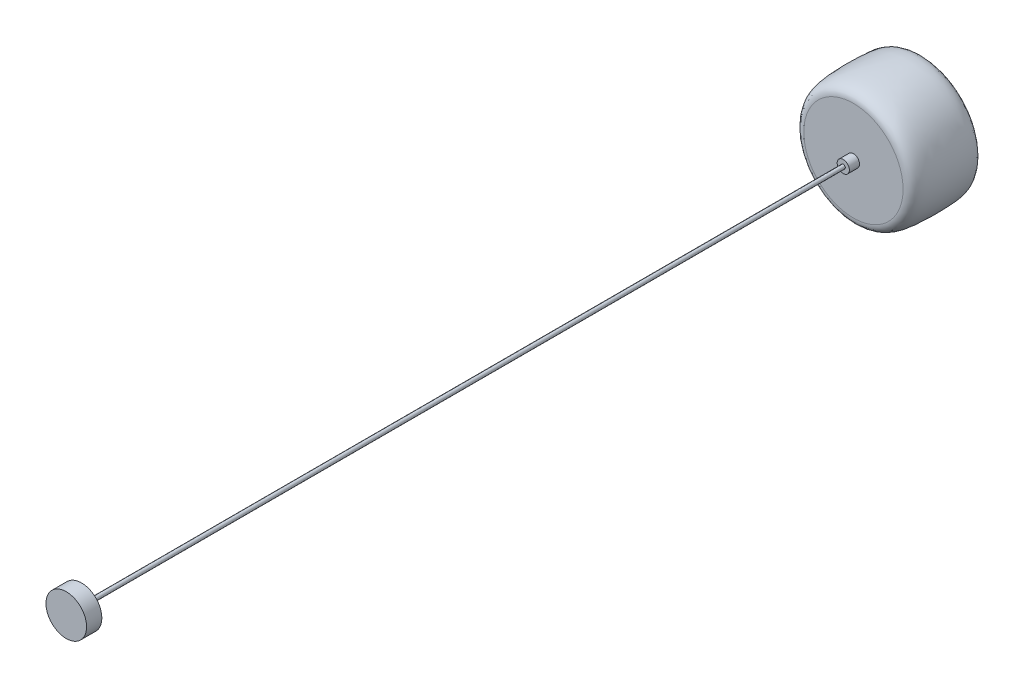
ISO-10303-21;
HEADER;
FILE_DESCRIPTION(('STEP AP214'),'2;1');
FILE_NAME('part.step','',(''),(''),'','','');
FILE_SCHEMA(('AUTOMOTIVE_DESIGN { 1 0 10303 214 1 1 1 1 }'));
ENDSEC;
DATA;
#1=APPLICATION_CONTEXT('core data for automotive mechanical design processes');
#2=APPLICATION_PROTOCOL_DEFINITION('international standard','automotive_design',2000,#1);
#3=PRODUCT_CONTEXT('',#1,'mechanical');
#4=PRODUCT('Part','Part','',(#3));
#5=PRODUCT_RELATED_PRODUCT_CATEGORY('part','',(#4));
#6=PRODUCT_DEFINITION_FORMATION('','',#4);
#7=PRODUCT_DEFINITION_CONTEXT('part definition',#1,'design');
#8=PRODUCT_DEFINITION('design','',#6,#7);
#9=PRODUCT_DEFINITION_SHAPE('','',#8);
#10=(LENGTH_UNIT() NAMED_UNIT(*) SI_UNIT(.MILLI.,.METRE.));
#11=(NAMED_UNIT(*) PLANE_ANGLE_UNIT() SI_UNIT($,.RADIAN.));
#12=(NAMED_UNIT(*) SI_UNIT($,.STERADIAN.) SOLID_ANGLE_UNIT());
#13=UNCERTAINTY_MEASURE_WITH_UNIT(LENGTH_MEASURE(1.E-05),#10,'distance_accuracy_value','');
#14=(GEOMETRIC_REPRESENTATION_CONTEXT(3) GLOBAL_UNCERTAINTY_ASSIGNED_CONTEXT((#13)) GLOBAL_UNIT_ASSIGNED_CONTEXT((#10,
#11,#12)) REPRESENTATION_CONTEXT('',''));
#15=CARTESIAN_POINT('',(0.,0.,0.));
#16=DIRECTION('',(0.,0.,1.));
#17=DIRECTION('',(1.,0.,0.));
#18=AXIS2_PLACEMENT_3D('',#15,#16,#17);
#19=CARTESIAN_POINT('',(-202.762577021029,-9.39848618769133E-13,538.));
#20=CARTESIAN_POINT('',(-202.762577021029,97.7625770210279,538.));
#21=CARTESIAN_POINT('',(-105.,97.7625770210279,538.));
#22=CARTESIAN_POINT('',(-7.23742297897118,97.7625770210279,538.));
#23=CARTESIAN_POINT('',(-7.23742297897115,-9.23402530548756E-13,538.));
#24=CARTESIAN_POINT('',(-7.23742297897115,-97.7625770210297,538.));
#25=CARTESIAN_POINT('',(-105.,-97.7625770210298,538.));
#26=CARTESIAN_POINT('',(-202.762577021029,-97.7625770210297,538.));
#27=CARTESIAN_POINT('',(-202.762577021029,-9.39848618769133E-13,538.));
#28=CARTESIAN_POINT('',(-173.508384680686,-9.39179281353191E-13,538.));
#29=CARTESIAN_POINT('',(-173.508384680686,68.5083846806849,538.));
#30=CARTESIAN_POINT('',(-105.,68.508384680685,538.));
#31=CARTESIAN_POINT('',(-36.4916153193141,68.5083846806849,538.));
#32=CARTESIAN_POINT('',(-36.4916153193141,-9.27654473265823E-13,538.));
#33=CARTESIAN_POINT('',(-36.4916153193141,-68.5083846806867,538.));
#34=CARTESIAN_POINT('',(-105.,-68.5083846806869,538.));
#35=CARTESIAN_POINT('',(-173.508384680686,-68.5083846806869,538.));
#36=CARTESIAN_POINT('',(-173.508384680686,-9.39179281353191E-13,538.));
#37=CARTESIAN_POINT('',(-144.254192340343,-9.38509943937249E-13,538.));
#38=CARTESIAN_POINT('',(-144.254192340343,39.254192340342,538.));
#39=CARTESIAN_POINT('',(-105.,39.254192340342,538.));
#40=CARTESIAN_POINT('',(-65.7458076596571,39.254192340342,538.));
#41=CARTESIAN_POINT('',(-65.7458076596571,-9.31906415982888E-13,538.));
#42=CARTESIAN_POINT('',(-65.7458076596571,-39.2541923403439,538.));
#43=CARTESIAN_POINT('',(-105.,-39.2541923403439,538.));
#44=CARTESIAN_POINT('',(-144.254192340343,-39.2541923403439,538.));
#45=CARTESIAN_POINT('',(-144.254192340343,-9.38509943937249E-13,538.));
#46=CARTESIAN_POINT('',(-115.,-9.37840606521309E-13,538.));
#47=CARTESIAN_POINT('',(-115.,9.99999999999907,538.));
#48=CARTESIAN_POINT('',(-105.,9.99999999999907,538.));
#49=CARTESIAN_POINT('',(-94.9999999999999,9.99999999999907,538.));
#50=CARTESIAN_POINT('',(-95.,-9.36158358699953E-13,538.));
#51=CARTESIAN_POINT('',(-94.9999999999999,-10.0000000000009,538.));
#52=CARTESIAN_POINT('',(-105.,-10.0000000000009,538.));
#53=CARTESIAN_POINT('',(-115.,-10.0000000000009,538.));
#54=CARTESIAN_POINT('',(-115.,-9.37840606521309E-13,538.));
#55=(BOUNDED_SURFACE() B_SPLINE_SURFACE(3,2,((#19,#20,#21,#22,#23,#24,#25,#26,#27),(#28,#29,#30,
#31,#32,#33,#34,#35,#36),(#37,#38,#39,#40,#41,#42,#43,#44,#45),(#46,#47,#48,#49,#50,#51,#52,#53,
#54)),.UNSPECIFIED.,.F.,.T.,.F.) B_SPLINE_SURFACE_WITH_KNOTS((4,4),(3,2,2,2,3),
(-183.788922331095,-12.4054077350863),(0.,191.105053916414,382.210107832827,573.31516174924,
764.420215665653),.UNSPECIFIED.) GEOMETRIC_REPRESENTATION_ITEM() RATIONAL_B_SPLINE_SURFACE(((1.,
0.707106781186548,1.,0.707106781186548,1.,0.707106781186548,1.,0.707106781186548,1.),(1.,
0.707106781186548,1.,0.707106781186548,1.,0.707106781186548,1.,0.707106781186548,1.),(1.,
0.707106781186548,1.,0.707106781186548,1.,0.707106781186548,1.,0.707106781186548,1.),(1.,
0.707106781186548,1.,0.707106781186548,1.,0.707106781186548,1.,0.707106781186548,1.))) REPRESENTATION_ITEM('') SURFACE());
#56=CARTESIAN_POINT('',(-202.762577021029,-9.39848618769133E-13,538.));
#57=CARTESIAN_POINT('',(-202.762577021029,97.7625770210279,538.));
#58=CARTESIAN_POINT('',(-105.,97.7625770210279,538.));
#59=CARTESIAN_POINT('',(-7.23742297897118,97.7625770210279,538.));
#60=CARTESIAN_POINT('',(-7.23742297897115,-9.23402530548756E-13,538.));
#61=CARTESIAN_POINT('',(-7.23742297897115,-97.7625770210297,538.));
#62=CARTESIAN_POINT('',(-105.,-97.7625770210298,538.));
#63=CARTESIAN_POINT('',(-202.762577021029,-97.7625770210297,538.));
#64=CARTESIAN_POINT('',(-202.762577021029,-9.39848618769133E-13,538.));
#65=(BOUNDED_CURVE() B_SPLINE_CURVE(2,(#56,#57,#58,#59,#60,#61,#62,#63,#64),.UNSPECIFIED.,.T.,
.F.) B_SPLINE_CURVE_WITH_KNOTS((3,2,2,2,3),(0.,191.105053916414,382.210107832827,
573.31516174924,764.420215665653),
.UNSPECIFIED.) CURVE() GEOMETRIC_REPRESENTATION_ITEM() RATIONAL_B_SPLINE_CURVE((1.,
0.707106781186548,1.,0.707106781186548,1.,0.707106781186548,1.,0.707106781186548,1.)) REPRESENTATION_ITEM(''));
#66=CARTESIAN_POINT('',(-202.762577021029,-9.39848618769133E-13,538.));
#67=VERTEX_POINT('',#66);
#68=EDGE_CURVE('E158',#67,#67,#65,.T.);
#69=CARTESIAN_POINT('',(-105.,-9.2894442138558E-13,538.));
#70=DIRECTION('',(0.,0.,1.));
#71=DIRECTION('',(1.,0.,0.));
#72=AXIS2_PLACEMENT_3D('',#69,#70,#71);
#73=CIRCLE('',#72,12.);
#74=CARTESIAN_POINT('',(-93.,-9.2894442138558E-13,538.));
#75=VERTEX_POINT('',#74);
#76=EDGE_CURVE('E161',#75,#75,#73,.T.);
#77=ORIENTED_EDGE('',*,*,#68,.F.);
#78=EDGE_LOOP('',(#77));
#79=FACE_BOUND('',#78,.T.);
#80=ORIENTED_EDGE('',*,*,#76,.F.);
#81=EDGE_LOOP('',(#80));
#82=FACE_BOUND('',#81,.T.);
#83=ADVANCED_FACE('F55',(#79,#82),#55,.T.);
#84=CARTESIAN_POINT('',(-95.,-9.37611806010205E-13,516.903740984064));
#85=CARTESIAN_POINT('',(-95.,-9.37611806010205E-13,567.751629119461));
#86=CARTESIAN_POINT('',(-94.9999999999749,-10.0000000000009,516.903740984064));
#87=CARTESIAN_POINT('',(-94.9999999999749,-10.0000000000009,567.751629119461));
#88=CARTESIAN_POINT('',(-105.,-10.0000000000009,516.903740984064));
#89=CARTESIAN_POINT('',(-105.,-10.0000000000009,567.751629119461));
#90=CARTESIAN_POINT('',(-114.999999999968,-10.0000000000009,516.903740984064));
#91=CARTESIAN_POINT('',(-114.999999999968,-10.0000000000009,567.751629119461));
#92=CARTESIAN_POINT('',(-115.,-9.38836452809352E-13,516.903740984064));
#93=CARTESIAN_POINT('',(-115.,-9.38836452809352E-13,567.751629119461));
#94=CARTESIAN_POINT('',(-114.999999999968,9.99999999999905,516.903740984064));
#95=CARTESIAN_POINT('',(-114.999999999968,9.99999999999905,567.751629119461));
#96=CARTESIAN_POINT('',(-105.,9.99999999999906,516.903740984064));
#97=CARTESIAN_POINT('',(-105.,9.99999999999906,567.751629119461));
#98=CARTESIAN_POINT('',(-94.9999999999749,9.99999999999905,516.903740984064));
#99=CARTESIAN_POINT('',(-94.9999999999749,9.99999999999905,567.751629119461));
#100=CARTESIAN_POINT('',(-95.,-9.37611806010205E-13,516.903740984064));
#101=CARTESIAN_POINT('',(-95.,-9.37611806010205E-13,567.751629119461));
#102=(BOUNDED_SURFACE() B_SPLINE_SURFACE(2,1,((#84,#85),(#86,#87),(#88,#89),(#90,#91),(#92,#93),
(#94,#95),(#96,#97),(#98,#99),(#100,#101)),.UNSPECIFIED.,.T.,.F.,
.F.) B_SPLINE_SURFACE_WITH_KNOTS((3,2,2,2,3),(2,2),(0.,15.7079632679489,31.415926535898,
47.1238898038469,62.8318530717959),(0.,8.65537010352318),
.UNSPECIFIED.) GEOMETRIC_REPRESENTATION_ITEM() RATIONAL_B_SPLINE_SURFACE(((1.,1.),
(0.707106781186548,0.707106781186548),(1.,1.),(0.707106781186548,0.707106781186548),(1.,1.),
(0.707106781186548,0.707106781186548),(1.,1.),(0.707106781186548,0.707106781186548),(1.,1.))) REPRESENTATION_ITEM('') SURFACE());
#103=CARTESIAN_POINT('',(-95.,-9.37611806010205E-13,538.));
#104=CARTESIAN_POINT('',(-94.9999999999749,9.99999999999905,538.));
#105=CARTESIAN_POINT('',(-105.,9.99999999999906,538.));
#106=CARTESIAN_POINT('',(-114.999999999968,9.99999999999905,538.));
#107=CARTESIAN_POINT('',(-115.,-9.38836452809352E-13,538.));
#108=CARTESIAN_POINT('',(-114.999999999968,-10.0000000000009,538.));
#109=CARTESIAN_POINT('',(-105.,-10.0000000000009,538.));
#110=CARTESIAN_POINT('',(-94.9999999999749,-10.0000000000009,538.));
#111=CARTESIAN_POINT('',(-95.,-9.37611806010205E-13,538.));
#112=(BOUNDED_CURVE() B_SPLINE_CURVE(2,(#103,#104,#105,#106,#107,#108,#109,#110,#111),
.UNSPECIFIED.,.T.,.F.) B_SPLINE_CURVE_WITH_KNOTS((3,2,2,2,3),(0.,15.707963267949,
31.415926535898,47.123889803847,62.8318530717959),
.UNSPECIFIED.) CURVE() GEOMETRIC_REPRESENTATION_ITEM() RATIONAL_B_SPLINE_CURVE((1.,
0.707106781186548,1.,0.707106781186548,1.,0.707106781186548,1.,0.707106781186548,1.)) REPRESENTATION_ITEM(''));
#113=CARTESIAN_POINT('',(-95.,-9.36158358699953E-13,538.));
#114=VERTEX_POINT('',#113);
#115=CARTESIAN_POINT('',(-115.,-8.28310601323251E-13,538.));
#116=VERTEX_POINT('',#115);
#117=EDGE_CURVE('E84',#114,#116,#112,.F.);
#118=CARTESIAN_POINT('',(-95.,-9.37611806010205E-13,538.));
#119=CARTESIAN_POINT('',(-94.9999999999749,9.99999999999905,538.));
#120=CARTESIAN_POINT('',(-105.,9.99999999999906,538.));
#121=CARTESIAN_POINT('',(-114.999999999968,9.99999999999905,538.));
#122=CARTESIAN_POINT('',(-115.,-9.38836452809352E-13,538.));
#123=CARTESIAN_POINT('',(-114.999999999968,-10.0000000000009,538.));
#124=CARTESIAN_POINT('',(-105.,-10.0000000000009,538.));
#125=CARTESIAN_POINT('',(-94.9999999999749,-10.0000000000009,538.));
#126=CARTESIAN_POINT('',(-95.,-9.37611806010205E-13,538.));
#127=(BOUNDED_CURVE() B_SPLINE_CURVE(2,(#118,#119,#120,#121,#122,#123,#124,#125,#126),
.UNSPECIFIED.,.T.,.F.) B_SPLINE_CURVE_WITH_KNOTS((3,2,2,2,3),(0.,15.707963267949,
31.415926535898,47.123889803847,62.8318530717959),
.UNSPECIFIED.) CURVE() GEOMETRIC_REPRESENTATION_ITEM() RATIONAL_B_SPLINE_CURVE((1.,
0.707106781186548,1.,0.707106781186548,1.,0.707106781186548,1.,0.707106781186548,1.)) REPRESENTATION_ITEM(''));
#128=EDGE_CURVE('E78',#116,#114,#127,.F.);
#129=CARTESIAN_POINT('',(-115.,-9.35138232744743E-13,531.000032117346));
#130=CARTESIAN_POINT('',(-115.,-10.0000000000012,531.000032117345));
#131=CARTESIAN_POINT('',(-105.,-10.0000000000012,531.000032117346));
#132=CARTESIAN_POINT('',(-94.9999999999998,-10.0000000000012,531.000032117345));
#133=CARTESIAN_POINT('',(-94.9999999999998,-9.3886073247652E-13,531.000032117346));
#134=CARTESIAN_POINT('',(-94.9999999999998,9.99999999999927,531.000032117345));
#135=CARTESIAN_POINT('',(-105.,9.99999999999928,531.000032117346));
#136=CARTESIAN_POINT('',(-115.,9.99999999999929,531.000032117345));
#137=CARTESIAN_POINT('',(-115.,-9.35138232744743E-13,531.000032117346));
#138=(BOUNDED_CURVE() B_SPLINE_CURVE(2,(#129,#130,#131,#132,#133,#134,#135,#136,#137),
.UNSPECIFIED.,.T.,.F.) B_SPLINE_CURVE_WITH_KNOTS((3,2,2,2,3),(0.,191.105053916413,
382.210107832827,573.315161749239,764.420215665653),
.UNSPECIFIED.) CURVE() GEOMETRIC_REPRESENTATION_ITEM() RATIONAL_B_SPLINE_CURVE((1.,
0.707106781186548,1.,0.707106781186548,1.,0.707106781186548,1.,0.707106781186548,1.)) REPRESENTATION_ITEM(''));
#139=CARTESIAN_POINT('',(-95.,-9.3802811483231E-13,531.000032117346));
#140=VERTEX_POINT('',#139);
#141=CARTESIAN_POINT('',(-114.99999999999,-9.36370972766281E-13,531.000032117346));
#142=VERTEX_POINT('',#141);
#143=EDGE_CURVE('E91',#140,#142,#138,.T.);
#144=CARTESIAN_POINT('',(-114.999999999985,-9.35138232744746E-13,531.000032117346));
#145=CARTESIAN_POINT('',(-114.999999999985,-9.99999999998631,531.000032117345));
#146=CARTESIAN_POINT('',(-105.,-9.99999999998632,531.000032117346));
#147=CARTESIAN_POINT('',(-95.0000000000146,-9.99999999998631,531.000032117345));
#148=CARTESIAN_POINT('',(-95.0000000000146,-9.38860732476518E-13,531.000032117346));
#149=CARTESIAN_POINT('',(-95.0000000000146,9.99999999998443,531.000032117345));
#150=CARTESIAN_POINT('',(-105.,9.99999999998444,531.000032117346));
#151=CARTESIAN_POINT('',(-114.999999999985,9.99999999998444,531.000032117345));
#152=CARTESIAN_POINT('',(-114.999999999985,-9.35138232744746E-13,531.000032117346));
#153=(BOUNDED_CURVE() B_SPLINE_CURVE(2,(#144,#145,#146,#147,#148,#149,#150,#151,#152),
.UNSPECIFIED.,.T.,.F.) B_SPLINE_CURVE_WITH_KNOTS((3,2,2,2,3),(0.,191.105053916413,
382.210107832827,573.315161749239,764.420215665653),
.UNSPECIFIED.) CURVE() GEOMETRIC_REPRESENTATION_ITEM() RATIONAL_B_SPLINE_CURVE((1.,
0.707106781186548,1.,0.707106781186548,1.,0.707106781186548,1.,0.707106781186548,1.)) REPRESENTATION_ITEM(''));
#154=EDGE_CURVE('E88',#142,#140,#153,.T.);
#155=ORIENTED_EDGE('',*,*,#117,.F.);
#156=ORIENTED_EDGE('',*,*,#128,.F.);
#157=EDGE_LOOP('',(#155,#156));
#158=FACE_BOUND('',#157,.T.);
#159=ORIENTED_EDGE('',*,*,#143,.F.);
#160=ORIENTED_EDGE('',*,*,#154,.F.);
#161=EDGE_LOOP('',(#159,#160));
#162=FACE_BOUND('',#161,.T.);
#163=ADVANCED_FACE('F57',(#158,#162),#102,.T.);
#164=CARTESIAN_POINT('',(-114.999999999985,-9.35138232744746E-13,531.000032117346));
#165=CARTESIAN_POINT('',(-114.999999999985,9.99999999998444,531.000032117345));
#166=CARTESIAN_POINT('',(-105.,9.99999999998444,531.000032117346));
#167=CARTESIAN_POINT('',(-95.0000000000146,9.99999999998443,531.000032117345));
#168=CARTESIAN_POINT('',(-95.0000000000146,-9.38860732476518E-13,531.000032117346));
#169=CARTESIAN_POINT('',(-95.0000000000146,-9.99999999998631,531.000032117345));
#170=CARTESIAN_POINT('',(-105.,-9.99999999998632,531.000032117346));
#171=CARTESIAN_POINT('',(-114.999999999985,-9.99999999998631,531.000032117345));
#172=CARTESIAN_POINT('',(-114.999999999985,-9.35138232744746E-13,531.000032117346));
#173=CARTESIAN_POINT('',(-144.232099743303,-9.28978880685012E-13,531.000126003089));
#174=CARTESIAN_POINT('',(-144.232099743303,39.2320997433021,531.000126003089));
#175=CARTESIAN_POINT('',(-105.,39.2320997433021,531.000126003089));
#176=CARTESIAN_POINT('',(-65.7679002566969,39.2320997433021,531.000126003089));
#177=CARTESIAN_POINT('',(-65.7679002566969,-9.4144018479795E-13,531.000126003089));
#178=CARTESIAN_POINT('',(-65.7679002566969,-39.232099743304,531.000126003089));
#179=CARTESIAN_POINT('',(-105.,-39.232099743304,531.000126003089));
#180=CARTESIAN_POINT('',(-144.232099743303,-39.232099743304,531.000126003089));
#181=CARTESIAN_POINT('',(-144.232099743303,-9.28978880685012E-13,531.000126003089));
#182=CARTESIAN_POINT('',(-173.46419948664,-9.31871440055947E-13,531.000219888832));
#183=CARTESIAN_POINT('',(-173.464199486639,68.4641994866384,531.000219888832));
#184=CARTESIAN_POINT('',(-105.,68.4641994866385,531.000219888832));
#185=CARTESIAN_POINT('',(-36.5358005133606,68.4641994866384,531.000219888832));
#186=CARTESIAN_POINT('',(-36.5358005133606,-9.34967725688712E-13,531.000219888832));
#187=CARTESIAN_POINT('',(-36.5358005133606,-68.4641994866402,531.000219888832));
#188=CARTESIAN_POINT('',(-105.,-68.4641994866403,531.000219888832));
#189=CARTESIAN_POINT('',(-173.464199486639,-68.4641994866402,531.000219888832));
#190=CARTESIAN_POINT('',(-173.46419948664,-9.31871440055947E-13,531.000219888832));
#191=CARTESIAN_POINT('',(-202.696299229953,-9.34763999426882E-13,531.000313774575));
#192=CARTESIAN_POINT('',(-202.696299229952,97.6962992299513,531.000313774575));
#193=CARTESIAN_POINT('',(-105.,97.6962992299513,531.000313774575));
#194=CARTESIAN_POINT('',(-7.30370077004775,97.6962992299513,531.000313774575));
#195=CARTESIAN_POINT('',(-7.30370077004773,-9.28495266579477E-13,531.000313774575));
#196=CARTESIAN_POINT('',(-7.30370077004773,-97.6962992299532,531.000313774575));
#197=CARTESIAN_POINT('',(-105.,-97.6962992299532,531.000313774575));
#198=CARTESIAN_POINT('',(-202.696299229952,-97.6962992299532,531.000313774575));
#199=CARTESIAN_POINT('',(-202.696299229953,-9.34763999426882E-13,531.000313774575));
#200=(BOUNDED_SURFACE() B_SPLINE_SURFACE(3,2,((#164,#165,#166,#167,#168,#169,#170,#171,#172),
(#173,#174,#175,#176,#177,#178,#179,#180,#181),(#182,#183,#184,#185,#186,#187,#188,#189,#190),
(#191,#192,#193,#194,#195,#196,#197,#198,#199)),.UNSPECIFIED.,.F.,.T.,
.F.) B_SPLINE_SURFACE_WITH_KNOTS((4,4),(3,2,2,2,3),(-499.545143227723,-328.174876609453),(0.,
191.105053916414,382.210107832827,573.31516174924,764.420215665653),
.UNSPECIFIED.) GEOMETRIC_REPRESENTATION_ITEM() RATIONAL_B_SPLINE_SURFACE(((1.,0.707106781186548,
1.,0.707106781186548,1.,0.707106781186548,1.,0.707106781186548,1.),(1.,0.707106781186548,1.,
0.707106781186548,1.,0.707106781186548,1.,0.707106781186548,1.),(1.,0.707106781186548,1.,
0.707106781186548,1.,0.707106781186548,1.,0.707106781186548,1.),(1.,0.707106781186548,1.,
0.707106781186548,1.,0.707106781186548,1.,0.707106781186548,1.))) REPRESENTATION_ITEM('') SURFACE());
#201=CARTESIAN_POINT('',(-202.696299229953,-9.34763999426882E-13,531.000313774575));
#202=CARTESIAN_POINT('',(-202.696299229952,97.6962992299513,531.000313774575));
#203=CARTESIAN_POINT('',(-105.,97.6962992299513,531.000313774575));
#204=CARTESIAN_POINT('',(-7.30370077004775,97.6962992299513,531.000313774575));
#205=CARTESIAN_POINT('',(-7.30370077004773,-9.28495266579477E-13,531.000313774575));
#206=CARTESIAN_POINT('',(-7.30370077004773,-97.6962992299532,531.000313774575));
#207=CARTESIAN_POINT('',(-105.,-97.6962992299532,531.000313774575));
#208=CARTESIAN_POINT('',(-202.696299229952,-97.6962992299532,531.000313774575));
#209=CARTESIAN_POINT('',(-202.696299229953,-9.34763999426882E-13,531.000313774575));
#210=(BOUNDED_CURVE() B_SPLINE_CURVE(2,(#201,#202,#203,#204,#205,#206,#207,#208,#209),
.UNSPECIFIED.,.T.,.F.) B_SPLINE_CURVE_WITH_KNOTS((3,2,2,2,3),(0.,191.105053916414,
382.210107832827,573.31516174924,764.420215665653),
.UNSPECIFIED.) CURVE() GEOMETRIC_REPRESENTATION_ITEM() RATIONAL_B_SPLINE_CURVE((1.,
0.707106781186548,1.,0.707106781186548,1.,0.707106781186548,1.,0.707106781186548,1.)) REPRESENTATION_ITEM(''));
#211=CARTESIAN_POINT('',(-202.696299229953,-9.34763999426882E-13,531.000313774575));
#212=VERTEX_POINT('',#211);
#213=EDGE_CURVE('E70',#212,#212,#210,.T.);
#214=ORIENTED_EDGE('',*,*,#213,.T.);
#215=EDGE_LOOP('',(#214));
#216=FACE_BOUND('',#215,.T.);
#217=ORIENTED_EDGE('',*,*,#143,.T.);
#218=ORIENTED_EDGE('',*,*,#154,.T.);
#219=EDGE_LOOP('',(#217,#218));
#220=FACE_BOUND('',#219,.T.);
#221=ADVANCED_FACE('F100',(#216,#220),#200,.T.);
#222=CARTESIAN_POINT('',(-202.696299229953,-9.34763999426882E-13,531.000313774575));
#223=CARTESIAN_POINT('',(-202.696299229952,97.6962992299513,531.000313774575));
#224=CARTESIAN_POINT('',(-105.,97.6962992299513,531.000313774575));
#225=CARTESIAN_POINT('',(-7.30370077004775,97.6962992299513,531.000313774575));
#226=CARTESIAN_POINT('',(-7.30370077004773,-9.28495266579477E-13,531.000313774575));
#227=CARTESIAN_POINT('',(-7.30370077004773,-97.6962992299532,531.000313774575));
#228=CARTESIAN_POINT('',(-105.,-97.6962992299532,531.000313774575));
#229=CARTESIAN_POINT('',(-202.696299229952,-97.6962992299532,531.000313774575));
#230=CARTESIAN_POINT('',(-202.696299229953,-9.34763999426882E-13,531.000313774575));
#231=CARTESIAN_POINT('',(-209.67450409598,-8.07855926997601E-13,531.11984691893));
#232=CARTESIAN_POINT('',(-209.674504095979,104.674504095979,531.11984691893));
#233=CARTESIAN_POINT('',(-105.,104.674504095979,531.11984691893));
#234=CARTESIAN_POINT('',(-0.3254959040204,104.674504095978,531.11984691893));
#235=CARTESIAN_POINT('',(-0.325495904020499,-1.05454875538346E-12,531.11984691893));
#236=CARTESIAN_POINT('',(-0.325495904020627,-104.67450409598,531.11984691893));
#237=CARTESIAN_POINT('',(-105.,-104.67450409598,531.11984691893));
#238=CARTESIAN_POINT('',(-209.674504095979,-104.67450409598,531.11984691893));
#239=CARTESIAN_POINT('',(-209.67450409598,-8.07855926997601E-13,531.11984691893));
#240=CARTESIAN_POINT('',(-215.842457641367,1.09129879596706E-13,521.418533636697));
#241=CARTESIAN_POINT('',(-215.842457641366,110.842457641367,521.418533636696));
#242=CARTESIAN_POINT('',(-105.,110.842457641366,521.418533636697));
#243=CARTESIAN_POINT('',(5.84245764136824,110.842457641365,521.418533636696));
#244=CARTESIAN_POINT('',(5.84245764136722,-1.9707792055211E-12,521.418533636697));
#245=CARTESIAN_POINT('',(5.84245764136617,-110.842457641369,521.418533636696));
#246=CARTESIAN_POINT('',(-105.,-110.842457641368,521.418533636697));
#247=CARTESIAN_POINT('',(-215.842457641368,-110.842457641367,521.418533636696));
#248=CARTESIAN_POINT('',(-215.842457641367,1.09129879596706E-13,521.418533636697));
#249=CARTESIAN_POINT('',(-218.939659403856,-9.20267986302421E-13,498.464920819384));
#250=CARTESIAN_POINT('',(-218.939659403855,113.939659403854,498.464920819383));
#251=CARTESIAN_POINT('',(-105.,113.939659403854,498.464920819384));
#252=CARTESIAN_POINT('',(8.93965940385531,113.939659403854,498.464920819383));
#253=CARTESIAN_POINT('',(8.93965940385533,-9.41002041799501E-13,498.464920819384));
#254=CARTESIAN_POINT('',(8.93965940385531,-113.939659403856,498.464920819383));
#255=CARTESIAN_POINT('',(-105.,-113.939659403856,498.464920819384));
#256=CARTESIAN_POINT('',(-218.939659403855,-113.939659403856,498.464920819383));
#257=CARTESIAN_POINT('',(-218.939659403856,-9.20267986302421E-13,498.464920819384));
#258=CARTESIAN_POINT('',(-219.768596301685,5.06427626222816E-13,475.859894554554));
#259=CARTESIAN_POINT('',(-219.768596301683,114.768596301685,475.859894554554));
#260=CARTESIAN_POINT('',(-104.999999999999,114.768596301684,475.859894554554));
#261=CARTESIAN_POINT('',(9.76859630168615,114.768596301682,475.859894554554));
#262=CARTESIAN_POINT('',(9.76859630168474,-2.36759613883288E-12,475.859894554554));
#263=CARTESIAN_POINT('',(9.76859630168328,-114.768596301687,475.859894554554));
#264=CARTESIAN_POINT('',(-105.000000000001,-114.768596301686,475.859894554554));
#265=CARTESIAN_POINT('',(-219.768596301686,-114.768596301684,475.859894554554));
#266=CARTESIAN_POINT('',(-219.768596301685,5.06427626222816E-13,475.859894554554));
#267=CARTESIAN_POINT('',(-219.724028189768,-1.54692235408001E-12,453.02451690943));
#268=CARTESIAN_POINT('',(-219.724028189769,114.724028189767,453.024516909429));
#269=CARTESIAN_POINT('',(-105.,114.724028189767,453.02451690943));
#270=CARTESIAN_POINT('',(9.72402818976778,114.724028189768,453.024516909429));
#271=CARTESIAN_POINT('',(9.72402818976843,-3.14251616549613E-13,453.02451690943));
#272=CARTESIAN_POINT('',(9.72402818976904,-114.724028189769,453.024516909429));
#273=CARTESIAN_POINT('',(-105.,-114.724028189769,453.02451690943));
#274=CARTESIAN_POINT('',(-219.724028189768,-114.72402818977,453.024516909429));
#275=CARTESIAN_POINT('',(-219.724028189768,-1.54692235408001E-12,453.02451690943));
#276=CARTESIAN_POINT('',(-219.046889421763,-7.8437757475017E-13,437.097337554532));
#277=CARTESIAN_POINT('',(-219.046889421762,114.046889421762,437.097337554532));
#278=CARTESIAN_POINT('',(-105.,114.046889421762,437.097337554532));
#279=CARTESIAN_POINT('',(9.04688942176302,114.046889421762,437.097337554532));
#280=CARTESIAN_POINT('',(9.0468894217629,-1.07687932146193E-12,437.097337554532));
#281=CARTESIAN_POINT('',(9.04688942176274,-114.046889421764,437.097337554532));
#282=CARTESIAN_POINT('',(-105.,-114.046889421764,437.097337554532));
#283=CARTESIAN_POINT('',(-219.046889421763,-114.046889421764,437.097337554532));
#284=CARTESIAN_POINT('',(-219.046889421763,-7.8437757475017E-13,437.097337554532));
#285=CARTESIAN_POINT('',(-218.63151717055,-1.55975047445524E-12,415.788249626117));
#286=CARTESIAN_POINT('',(-218.631517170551,113.631517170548,415.788249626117));
#287=CARTESIAN_POINT('',(-105.,113.631517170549,415.788249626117));
#288=CARTESIAN_POINT('',(8.6315171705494,113.63151717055,415.788249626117));
#289=CARTESIAN_POINT('',(8.63151717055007,-3.01557290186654E-13,415.788249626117));
#290=CARTESIAN_POINT('',(8.63151717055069,-113.63151717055,415.788249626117));
#291=CARTESIAN_POINT('',(-105.,-113.631517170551,415.788249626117));
#292=CARTESIAN_POINT('',(-218.631517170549,-113.631517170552,415.788249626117));
#293=CARTESIAN_POINT('',(-218.63151717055,-1.55975047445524E-12,415.788249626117));
#294=CARTESIAN_POINT('',(-213.353672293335,-1.19591363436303E-12,409.652207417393));
#295=CARTESIAN_POINT('',(-213.353672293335,108.353672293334,409.652207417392));
#296=CARTESIAN_POINT('',(-105.,108.353672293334,409.652207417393));
#297=CARTESIAN_POINT('',(3.35367229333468,108.353672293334,409.652207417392));
#298=CARTESIAN_POINT('',(3.35367229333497,-6.66040479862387E-13,409.652207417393));
#299=CARTESIAN_POINT('',(3.35367229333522,-108.353672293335,409.652207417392));
#300=CARTESIAN_POINT('',(-105.,-108.353672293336,409.652207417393));
#301=CARTESIAN_POINT('',(-213.353672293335,-108.353672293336,409.652207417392));
#302=CARTESIAN_POINT('',(-213.353672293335,-1.19591363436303E-12,409.652207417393));
#303=CARTESIAN_POINT('',(-207.173456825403,-9.72202383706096E-13,409.242963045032));
#304=CARTESIAN_POINT('',(-207.173456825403,102.173456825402,409.242963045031));
#305=CARTESIAN_POINT('',(-105.,102.173456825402,409.242963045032));
#306=CARTESIAN_POINT('',(-2.82654317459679,102.173456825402,409.242963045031));
#307=CARTESIAN_POINT('',(-2.82654317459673,-8.90508588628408E-13,409.242963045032));
#308=CARTESIAN_POINT('',(-2.82654317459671,-102.173456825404,409.242963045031));
#309=CARTESIAN_POINT('',(-105.,-102.173456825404,409.242963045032));
#310=CARTESIAN_POINT('',(-207.173456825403,-102.173456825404,409.242963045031));
#311=CARTESIAN_POINT('',(-207.173456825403,-9.72202383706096E-13,409.242963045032));
#312=CARTESIAN_POINT('',(-206.296171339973,-9.54783542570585E-13,409.184870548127));
#313=CARTESIAN_POINT('',(-206.296171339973,101.296171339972,409.184870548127));
#314=CARTESIAN_POINT('',(-105.,101.296171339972,409.184870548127));
#315=CARTESIAN_POINT('',(-3.70382866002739,101.296171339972,409.184870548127));
#316=CARTESIAN_POINT('',(-3.70382866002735,-9.08034866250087E-13,409.184870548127));
#317=CARTESIAN_POINT('',(-3.70382866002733,-101.296171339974,409.184870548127));
#318=CARTESIAN_POINT('',(-105.,-101.296171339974,409.184870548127));
#319=CARTESIAN_POINT('',(-206.296171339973,-101.296171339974,409.184870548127));
#320=CARTESIAN_POINT('',(-206.296171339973,-9.54783542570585E-13,409.184870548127));
#321=CARTESIAN_POINT('',(-205.614128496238,-9.40285578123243E-13,408.630053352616));
#322=CARTESIAN_POINT('',(-205.614128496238,100.614128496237,408.630053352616));
#323=CARTESIAN_POINT('',(-105.,100.614128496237,408.630053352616));
#324=CARTESIAN_POINT('',(-4.38587150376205,100.614128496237,408.630053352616));
#325=CARTESIAN_POINT('',(-4.38587150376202,-9.22616356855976E-13,408.630053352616));
#326=CARTESIAN_POINT('',(-4.38587150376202,-100.614128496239,408.630053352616));
#327=CARTESIAN_POINT('',(-105.,-100.614128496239,408.630053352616));
#328=CARTESIAN_POINT('',(-205.614128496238,-100.614128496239,408.630053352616));
#329=CARTESIAN_POINT('',(-205.614128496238,-9.40285578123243E-13,408.630053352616));
#330=CARTESIAN_POINT('',(-205.378663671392,-9.34051045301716E-13,407.782963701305));
#331=CARTESIAN_POINT('',(-205.378663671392,100.378663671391,407.782963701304));
#332=CARTESIAN_POINT('',(-105.,100.378663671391,407.782963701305));
#333=CARTESIAN_POINT('',(-4.62133632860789,100.378663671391,407.782963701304));
#334=CARTESIAN_POINT('',(-4.62133632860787,-9.28879725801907E-13,407.782963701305));
#335=CARTESIAN_POINT('',(-4.62133632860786,-100.378663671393,407.782963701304));
#336=CARTESIAN_POINT('',(-105.,-100.378663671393,407.782963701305));
#337=CARTESIAN_POINT('',(-205.378663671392,-100.378663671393,407.782963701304));
#338=CARTESIAN_POINT('',(-205.378663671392,-9.34051045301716E-13,407.782963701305));
#339=CARTESIAN_POINT('',(-205.190243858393,-9.36249822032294E-13,407.105119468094));
#340=CARTESIAN_POINT('',(-205.190243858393,100.190243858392,407.105119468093));
#341=CARTESIAN_POINT('',(-105.,100.190243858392,407.105119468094));
#342=CARTESIAN_POINT('',(-4.80975614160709,100.190243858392,407.105119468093));
#343=CARTESIAN_POINT('',(-4.80975614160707,-9.26704023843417E-13,407.105119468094));
#344=CARTESIAN_POINT('',(-4.80975614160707,-100.190243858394,407.105119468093));
#345=CARTESIAN_POINT('',(-105.,-100.190243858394,407.105119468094));
#346=CARTESIAN_POINT('',(-205.190243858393,-100.190243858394,407.105119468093));
#347=CARTESIAN_POINT('',(-205.190243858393,-9.36249822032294E-13,407.105119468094));
#348=CARTESIAN_POINT('',(-204.997664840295,-9.38936732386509E-13,405.653191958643));
#349=CARTESIAN_POINT('',(-204.997664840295,99.9976648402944,405.653191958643));
#350=CARTESIAN_POINT('',(-105.,99.9976648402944,405.653191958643));
#351=CARTESIAN_POINT('',(-5.0023351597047,99.9976648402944,405.653191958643));
#352=CARTESIAN_POINT('',(-5.00233515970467,-9.24040697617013E-13,405.653191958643));
#353=CARTESIAN_POINT('',(-5.00233515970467,-99.9976648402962,405.653191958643));
#354=CARTESIAN_POINT('',(-105.,-99.9976648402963,405.653191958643));
#355=CARTESIAN_POINT('',(-204.997664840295,-99.9976648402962,405.653191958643));
#356=CARTESIAN_POINT('',(-204.997664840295,-9.38936732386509E-13,405.653191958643));
#357=CARTESIAN_POINT('',(-205.355264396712,-9.36333341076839E-13,404.229127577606));
#358=CARTESIAN_POINT('',(-205.355264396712,100.355264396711,404.229127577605));
#359=CARTESIAN_POINT('',(-105.,100.355264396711,404.229127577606));
#360=CARTESIAN_POINT('',(-4.64473560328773,100.355264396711,404.229127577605));
#361=CARTESIAN_POINT('',(-4.6447356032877,-9.26600295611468E-13,404.229127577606));
#362=CARTESIAN_POINT('',(-4.6447356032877,-100.355264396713,404.229127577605));
#363=CARTESIAN_POINT('',(-105.,-100.355264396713,404.229127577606));
#364=CARTESIAN_POINT('',(-205.355264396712,-100.355264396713,404.229127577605));
#365=CARTESIAN_POINT('',(-205.355264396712,-9.36333341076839E-13,404.229127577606));
#366=CARTESIAN_POINT('',(-205.640392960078,-9.33999610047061E-13,403.539091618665));
#367=CARTESIAN_POINT('',(-205.640392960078,100.640392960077,403.539091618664));
#368=CARTESIAN_POINT('',(-105.,100.640392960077,403.539091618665));
#369=CARTESIAN_POINT('',(-4.35960703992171,100.640392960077,403.539091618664));
#370=CARTESIAN_POINT('',(-4.35960703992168,-9.28899108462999E-13,403.539091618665));
#371=CARTESIAN_POINT('',(-4.35960703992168,-100.640392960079,403.539091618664));
#372=CARTESIAN_POINT('',(-105.,-100.640392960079,403.539091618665));
#373=CARTESIAN_POINT('',(-205.640392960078,-100.640392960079,403.539091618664));
#374=CARTESIAN_POINT('',(-205.640392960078,-9.33999610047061E-13,403.539091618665));
#375=CARTESIAN_POINT('',(-205.988777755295,-9.3046179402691E-13,402.69597006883));
#376=CARTESIAN_POINT('',(-205.988777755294,100.988777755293,402.69597006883));
#377=CARTESIAN_POINT('',(-105.,100.988777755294,402.69597006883));
#378=CARTESIAN_POINT('',(-4.01122224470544,100.988777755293,402.69597006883));
#379=CARTESIAN_POINT('',(-4.01122224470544,-9.32394259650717E-13,402.69597006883));
#380=CARTESIAN_POINT('',(-4.01122224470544,-100.988777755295,402.69597006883));
#381=CARTESIAN_POINT('',(-105.,-100.988777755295,402.69597006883));
#382=CARTESIAN_POINT('',(-205.988777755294,-100.988777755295,402.69597006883));
#383=CARTESIAN_POINT('',(-205.988777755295,-9.3046179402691E-13,402.69597006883));
#384=CARTESIAN_POINT('',(-206.770296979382,-9.28162889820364E-13,402.225381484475));
#385=CARTESIAN_POINT('',(-206.770296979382,101.770296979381,402.225381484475));
#386=CARTESIAN_POINT('',(-105.,101.770296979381,402.225381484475));
#387=CARTESIAN_POINT('',(-3.22970302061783,101.770296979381,402.225381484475));
#388=CARTESIAN_POINT('',(-3.22970302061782,-9.34597455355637E-13,402.225381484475));
#389=CARTESIAN_POINT('',(-3.22970302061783,-101.770296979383,402.225381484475));
#390=CARTESIAN_POINT('',(-105.,-101.770296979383,402.225381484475));
#391=CARTESIAN_POINT('',(-206.770296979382,-101.770296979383,402.225381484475));
#392=CARTESIAN_POINT('',(-206.770296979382,-9.28162889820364E-13,402.225381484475));
#393=CARTESIAN_POINT('',(-207.678450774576,-9.28004492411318E-13,402.3118834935));
#394=CARTESIAN_POINT('',(-207.678450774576,102.678450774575,402.3118834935));
#395=CARTESIAN_POINT('',(-105.,102.678450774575,402.3118834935));
#396=CARTESIAN_POINT('',(-2.32154922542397,102.678450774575,402.3118834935));
#397=CARTESIAN_POINT('',(-2.32154922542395,-9.34644636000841E-13,402.3118834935));
#398=CARTESIAN_POINT('',(-2.32154922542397,-102.678450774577,402.3118834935));
#399=CARTESIAN_POINT('',(-105.,-102.678450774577,402.3118834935));
#400=CARTESIAN_POINT('',(-207.678450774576,-102.678450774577,402.3118834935));
#401=CARTESIAN_POINT('',(-207.678450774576,-9.28004492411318E-13,402.3118834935));
#402=CARTESIAN_POINT('',(-223.962146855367,-9.27903389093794E-13,403.862912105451));
#403=CARTESIAN_POINT('',(-223.962146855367,118.962146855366,403.86291210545));
#404=CARTESIAN_POINT('',(-105.,118.962146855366,403.862912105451));
#405=CARTESIAN_POINT('',(13.9621468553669,118.962146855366,403.86291210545));
#406=CARTESIAN_POINT('',(13.9621468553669,-9.32751561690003E-13,403.862912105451));
#407=CARTESIAN_POINT('',(13.9621468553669,-118.962146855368,403.86291210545));
#408=CARTESIAN_POINT('',(-105.,-118.962146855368,403.862912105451));
#409=CARTESIAN_POINT('',(-223.962146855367,-118.962146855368,403.86291210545));
#410=CARTESIAN_POINT('',(-223.962146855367,-9.27903389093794E-13,403.862912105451));
#411=CARTESIAN_POINT('',(-226.477466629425,-9.39848618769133E-13,426.688938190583));
#412=CARTESIAN_POINT('',(-226.477466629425,121.477466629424,426.688938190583));
#413=CARTESIAN_POINT('',(-105.,121.477466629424,426.688938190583));
#414=CARTESIAN_POINT('',(16.4774666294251,121.477466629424,426.688938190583));
#415=CARTESIAN_POINT('',(16.4774666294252,-9.20498294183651E-13,426.688938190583));
#416=CARTESIAN_POINT('',(16.4774666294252,-121.477466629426,426.688938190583));
#417=CARTESIAN_POINT('',(-105.,-121.477466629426,426.688938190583));
#418=CARTESIAN_POINT('',(-226.477466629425,-121.477466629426,426.688938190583));
#419=CARTESIAN_POINT('',(-226.477466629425,-9.39848618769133E-13,426.688938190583));
#420=CARTESIAN_POINT('',(-227.662341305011,-9.39848618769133E-13,516.455446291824));
#421=CARTESIAN_POINT('',(-227.662341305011,122.66234130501,516.455446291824));
#422=CARTESIAN_POINT('',(-105.,122.66234130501,516.455446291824));
#423=CARTESIAN_POINT('',(17.662341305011,122.66234130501,516.455446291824));
#424=CARTESIAN_POINT('',(17.6623413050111,-9.20353188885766E-13,516.455446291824));
#425=CARTESIAN_POINT('',(17.6623413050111,-122.662341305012,516.455446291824));
#426=CARTESIAN_POINT('',(-105.,-122.662341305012,516.455446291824));
#427=CARTESIAN_POINT('',(-227.662341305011,-122.662341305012,516.455446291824));
#428=CARTESIAN_POINT('',(-227.662341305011,-9.39848618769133E-13,516.455446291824));
#429=CARTESIAN_POINT('',(-216.721120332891,-9.39848618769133E-13,537.86783101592));
#430=CARTESIAN_POINT('',(-216.721120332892,111.721120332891,537.86783101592));
#431=CARTESIAN_POINT('',(-105.,111.721120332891,537.86783101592));
#432=CARTESIAN_POINT('',(6.72112033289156,111.721120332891,537.86783101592));
#433=CARTESIAN_POINT('',(6.72112033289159,-9.21693102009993E-13,537.86783101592));
#434=CARTESIAN_POINT('',(6.72112033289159,-111.721120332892,537.86783101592));
#435=CARTESIAN_POINT('',(-105.,-111.721120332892,537.86783101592));
#436=CARTESIAN_POINT('',(-216.721120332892,-111.721120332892,537.86783101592));
#437=CARTESIAN_POINT('',(-216.721120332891,-9.39848618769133E-13,537.86783101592));
#438=CARTESIAN_POINT('',(-202.762577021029,-9.39848618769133E-13,538.));
#439=CARTESIAN_POINT('',(-202.762577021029,97.7625770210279,538.));
#440=CARTESIAN_POINT('',(-105.,97.7625770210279,538.));
#441=CARTESIAN_POINT('',(-7.23742297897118,97.7625770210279,538.));
#442=CARTESIAN_POINT('',(-7.23742297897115,-9.23402530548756E-13,538.));
#443=CARTESIAN_POINT('',(-7.23742297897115,-97.7625770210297,538.));
#444=CARTESIAN_POINT('',(-105.,-97.7625770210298,538.));
#445=CARTESIAN_POINT('',(-202.762577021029,-97.7625770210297,538.));
#446=CARTESIAN_POINT('',(-202.762577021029,-9.39848618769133E-13,538.));
#447=(BOUNDED_SURFACE() B_SPLINE_SURFACE(3,2,((#222,#223,#224,#225,#226,#227,#228,#229,#230),
(#231,#232,#233,#234,#235,#236,#237,#238,#239),(#240,#241,#242,#243,#244,#245,#246,#247,#248),
(#249,#250,#251,#252,#253,#254,#255,#256,#257),(#258,#259,#260,#261,#262,#263,#264,#265,#266),
(#267,#268,#269,#270,#271,#272,#273,#274,#275),(#276,#277,#278,#279,#280,#281,#282,#283,#284),
(#285,#286,#287,#288,#289,#290,#291,#292,#293),(#294,#295,#296,#297,#298,#299,#300,#301,#302),
(#303,#304,#305,#306,#307,#308,#309,#310,#311),(#312,#313,#314,#315,#316,#317,#318,#319,#320),
(#321,#322,#323,#324,#325,#326,#327,#328,#329),(#330,#331,#332,#333,#334,#335,#336,#337,#338),
(#339,#340,#341,#342,#343,#344,#345,#346,#347),(#348,#349,#350,#351,#352,#353,#354,#355,#356),
(#357,#358,#359,#360,#361,#362,#363,#364,#365),(#366,#367,#368,#369,#370,#371,#372,#373,#374),
(#375,#376,#377,#378,#379,#380,#381,#382,#383),(#384,#385,#386,#387,#388,#389,#390,#391,#392),
(#393,#394,#395,#396,#397,#398,#399,#400,#401),(#402,#403,#404,#405,#406,#407,#408,#409,#410),
(#411,#412,#413,#414,#415,#416,#417,#418,#419),(#420,#421,#422,#423,#424,#425,#426,#427,#428),
(#429,#430,#431,#432,#433,#434,#435,#436,#437),(#438,#439,#440,#441,#442,#443,#444,#445,#446)),
.UNSPECIFIED.,.F.,.T.,.F.) B_SPLINE_SURFACE_WITH_KNOTS((4,1,1,1,1,1,1,3,3,1,3,3,1,1,4),(3,2,2,2,
3),(-328.174876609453,-328.049876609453,-327.924876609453,-327.674876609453,-327.549876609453,
-327.424876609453,-327.299876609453,-327.182504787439,-324.715405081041,-322.635049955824,
-320.429403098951,-317.881564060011,-273.9644397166,-228.876681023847,-183.788922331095),(0.,
191.105053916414,382.210107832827,573.31516174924,764.420215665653),
.UNSPECIFIED.) GEOMETRIC_REPRESENTATION_ITEM() RATIONAL_B_SPLINE_SURFACE(((1.,0.707106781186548,
1.,0.707106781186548,1.,0.707106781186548,1.,0.707106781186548,1.),(1.,0.707106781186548,1.,
0.707106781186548,1.,0.707106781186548,1.,0.707106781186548,1.),(1.,0.707106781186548,1.,
0.707106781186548,1.,0.707106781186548,1.,0.707106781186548,1.),(1.,0.707106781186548,1.,
0.707106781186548,1.,0.707106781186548,1.,0.707106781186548,1.),(1.,0.707106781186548,1.,
0.707106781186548,1.,0.707106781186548,1.,0.707106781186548,1.),(1.,0.707106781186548,1.,
0.707106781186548,1.,0.707106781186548,1.,0.707106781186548,1.),(1.,0.707106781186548,1.,
0.707106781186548,1.,0.707106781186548,1.,0.707106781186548,1.),(1.,0.707106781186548,1.,
0.707106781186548,1.,0.707106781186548,1.,0.707106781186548,1.),(1.,0.707106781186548,1.,
0.707106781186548,1.,0.707106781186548,1.,0.707106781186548,1.),(1.,0.707106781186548,1.,
0.707106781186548,1.,0.707106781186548,1.,0.707106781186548,1.),(0.877165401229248,
0.62024960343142,0.877165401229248,0.62024960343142,0.877165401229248,0.62024960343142,
0.877165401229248,0.62024960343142,0.877165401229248),(0.877165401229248,0.62024960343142,
0.877165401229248,0.62024960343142,0.877165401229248,0.62024960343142,0.877165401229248,
0.62024960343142,0.877165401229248),(1.,0.707106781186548,1.,0.707106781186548,1.,
0.707106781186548,1.,0.707106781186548,1.),(1.,0.707106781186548,1.,0.707106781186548,1.,
0.707106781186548,1.,0.707106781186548,1.),(1.,0.707106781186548,1.,0.707106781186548,1.,
0.707106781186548,1.,0.707106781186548,1.),(1.,0.707106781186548,1.,0.707106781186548,1.,
0.707106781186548,1.,0.707106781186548,1.),(1.,0.707106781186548,1.,0.707106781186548,1.,
0.707106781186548,1.,0.707106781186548,1.),(0.869271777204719,0.614667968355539,
0.869271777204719,0.614667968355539,0.869271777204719,0.614667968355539,0.869271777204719,
0.614667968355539,0.869271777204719),(0.869271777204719,0.614667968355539,0.869271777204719,
0.614667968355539,0.869271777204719,0.614667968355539,0.869271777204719,0.614667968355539,
0.869271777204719),(1.,0.707106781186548,1.,0.707106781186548,1.,0.707106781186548,1.,
0.707106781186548,1.),(1.,0.707106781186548,1.,0.707106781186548,1.,0.707106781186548,1.,
0.707106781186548,1.),(1.,0.707106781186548,1.,0.707106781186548,1.,0.707106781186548,1.,
0.707106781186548,1.),(1.,0.707106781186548,1.,0.707106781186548,1.,0.707106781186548,1.,
0.707106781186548,1.),(1.,0.707106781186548,1.,0.707106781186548,1.,0.707106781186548,1.,
0.707106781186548,1.),(1.,0.707106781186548,1.,0.707106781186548,1.,0.707106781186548,1.,
0.707106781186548,1.))) REPRESENTATION_ITEM('') SURFACE());
#448=ORIENTED_EDGE('',*,*,#68,.T.);
#449=EDGE_LOOP('',(#448));
#450=FACE_BOUND('',#449,.T.);
#451=ORIENTED_EDGE('',*,*,#213,.F.);
#452=EDGE_LOOP('',(#451));
#453=FACE_BOUND('',#452,.T.);
#454=ADVANCED_FACE('F123',(#450,#453),#447,.T.);
#455=CARTESIAN_POINT('',(-105.,-9.2894442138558E-13,538.));
#456=DIRECTION('',(0.,0.,1.));
#457=DIRECTION('',(1.,0.,0.));
#458=AXIS2_PLACEMENT_3D('',#455,#456,#457);
#459=PLANE('',#458);
#460=ORIENTED_EDGE('',*,*,#128,.T.);
#461=ORIENTED_EDGE('',*,*,#117,.T.);
#462=EDGE_LOOP('',(#460,#461));
#463=FACE_BOUND('',#462,.T.);
#464=ADVANCED_FACE('F136',(#463),#459,.F.);
#465=CARTESIAN_POINT('',(-105.,-9.2894442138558E-13,558.));
#466=DIRECTION('',(0.,0.,-1.));
#467=DIRECTION('',(-1.,0.,0.));
#468=AXIS2_PLACEMENT_3D('',#465,#466,#467);
#469=CYLINDRICAL_SURFACE('',#468,12.);
#470=CARTESIAN_POINT('',(-105.,-9.2894442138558E-13,558.));
#471=DIRECTION('',(0.,0.,1.));
#472=DIRECTION('',(1.,0.,0.));
#473=AXIS2_PLACEMENT_3D('',#470,#471,#472);
#474=CIRCLE('',#473,12.);
#475=CARTESIAN_POINT('',(-93.,-9.2894442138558E-13,558.));
#476=VERTEX_POINT('',#475);
#477=EDGE_CURVE('E96',#476,#476,#474,.T.);
#478=ORIENTED_EDGE('',*,*,#477,.F.);
#479=EDGE_LOOP('',(#478));
#480=FACE_BOUND('',#479,.T.);
#481=ORIENTED_EDGE('',*,*,#76,.T.);
#482=EDGE_LOOP('',(#481));
#483=FACE_BOUND('',#482,.T.);
#484=ADVANCED_FACE('F125',(#480,#483),#469,.T.);
#485=CARTESIAN_POINT('',(-105.,-9.2894442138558E-13,558.));
#486=DIRECTION('',(0.,0.,1.));
#487=DIRECTION('',(1.,0.,0.));
#488=AXIS2_PLACEMENT_3D('',#485,#486,#487);
#489=PLANE('',#488);
#490=CARTESIAN_POINT('',(-105.,-9.2894442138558E-13,558.));
#491=DIRECTION('',(0.,0.,1.));
#492=DIRECTION('',(1.,0.,0.));
#493=AXIS2_PLACEMENT_3D('',#490,#491,#492);
#494=CIRCLE('',#493,4.00000000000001);
#495=CARTESIAN_POINT('',(-101.,-9.2894442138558E-13,558.));
#496=VERTEX_POINT('',#495);
#497=EDGE_CURVE('E11',#496,#496,#494,.T.);
#498=ORIENTED_EDGE('',*,*,#497,.F.);
#499=EDGE_LOOP('',(#498));
#500=FACE_BOUND('',#499,.T.);
#501=ORIENTED_EDGE('',*,*,#477,.T.);
#502=EDGE_LOOP('',(#501));
#503=FACE_BOUND('',#502,.T.);
#504=ADVANCED_FACE('F188',(#500,#503),#489,.T.);
#505=CARTESIAN_POINT('',(-105.,-9.2894442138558E-13,2058.));
#506=DIRECTION('',(0.,0.,-1.));
#507=DIRECTION('',(-1.,0.,0.));
#508=AXIS2_PLACEMENT_3D('',#505,#506,#507);
#509=CYLINDRICAL_SURFACE('',#508,4.00000000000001);
#510=CARTESIAN_POINT('',(-105.,-9.2894442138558E-13,2058.));
#511=DIRECTION('',(0.,0.,1.));
#512=DIRECTION('',(1.,0.,0.));
#513=AXIS2_PLACEMENT_3D('',#510,#511,#512);
#514=CIRCLE('',#513,4.00000000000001);
#515=CARTESIAN_POINT('',(-101.,-9.2894442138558E-13,2058.));
#516=VERTEX_POINT('',#515);
#517=EDGE_CURVE('E164',#516,#516,#514,.T.);
#518=ORIENTED_EDGE('',*,*,#517,.F.);
#519=EDGE_LOOP('',(#518));
#520=FACE_BOUND('',#519,.T.);
#521=ORIENTED_EDGE('',*,*,#497,.T.);
#522=EDGE_LOOP('',(#521));
#523=FACE_BOUND('',#522,.T.);
#524=ADVANCED_FACE('F199',(#520,#523),#509,.T.);
#525=CARTESIAN_POINT('',(-105.,-9.2894442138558E-13,2088.));
#526=DIRECTION('',(0.,0.,-1.));
#527=DIRECTION('',(-1.,0.,0.));
#528=AXIS2_PLACEMENT_3D('',#525,#526,#527);
#529=CYLINDRICAL_SURFACE('',#528,40.);
#530=CARTESIAN_POINT('',(-105.,-9.2894442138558E-13,2088.));
#531=DIRECTION('',(0.,0.,1.));
#532=DIRECTION('',(1.,0.,0.));
#533=AXIS2_PLACEMENT_3D('',#530,#531,#532);
#534=CIRCLE('',#533,40.);
#535=CARTESIAN_POINT('',(-65.,-9.2894442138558E-13,2088.));
#536=VERTEX_POINT('',#535);
#537=EDGE_CURVE('E171',#536,#536,#534,.T.);
#538=ORIENTED_EDGE('',*,*,#537,.F.);
#539=EDGE_LOOP('',(#538));
#540=FACE_BOUND('',#539,.T.);
#541=CARTESIAN_POINT('',(-105.,-9.2894442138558E-13,2058.));
#542=DIRECTION('',(0.,0.,1.));
#543=DIRECTION('',(1.,0.,0.));
#544=AXIS2_PLACEMENT_3D('',#541,#542,#543);
#545=CIRCLE('',#544,40.);
#546=CARTESIAN_POINT('',(-65.,-9.2894442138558E-13,2058.));
#547=VERTEX_POINT('',#546);
#548=EDGE_CURVE('E220',#547,#547,#545,.T.);
#549=ORIENTED_EDGE('',*,*,#548,.T.);
#550=EDGE_LOOP('',(#549));
#551=FACE_BOUND('',#550,.T.);
#552=ADVANCED_FACE('F203',(#540,#551),#529,.T.);
#553=CARTESIAN_POINT('',(-105.,-9.2894442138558E-13,2088.));
#554=DIRECTION('',(0.,0.,1.));
#555=DIRECTION('',(1.,0.,0.));
#556=AXIS2_PLACEMENT_3D('',#553,#554,#555);
#557=PLANE('',#556);
#558=ORIENTED_EDGE('',*,*,#537,.T.);
#559=EDGE_LOOP('',(#558));
#560=FACE_BOUND('',#559,.T.);
#561=ADVANCED_FACE('F207',(#560),#557,.T.);
#562=CARTESIAN_POINT('',(-105.,-9.2894442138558E-13,2058.));
#563=DIRECTION('',(0.,0.,1.));
#564=DIRECTION('',(1.,0.,0.));
#565=AXIS2_PLACEMENT_3D('',#562,#563,#564);
#566=PLANE('',#565);
#567=ORIENTED_EDGE('',*,*,#517,.T.);
#568=EDGE_LOOP('',(#567));
#569=FACE_BOUND('',#568,.T.);
#570=ORIENTED_EDGE('',*,*,#548,.F.);
#571=EDGE_LOOP('',(#570));
#572=FACE_BOUND('',#571,.T.);
#573=ADVANCED_FACE('F209',(#569,#572),#566,.F.);
#574=CLOSED_SHELL('',(#83,#163,#221,#454,#464,#484,#504,#524,#552,#561,#573));
#575=MANIFOLD_SOLID_BREP('B2',#574);
#576=ADVANCED_BREP_SHAPE_REPRESENTATION('',(#18,#575),#14);
#577=SHAPE_DEFINITION_REPRESENTATION(#9,#576);
ENDSEC;
END-ISO-10303-21;
